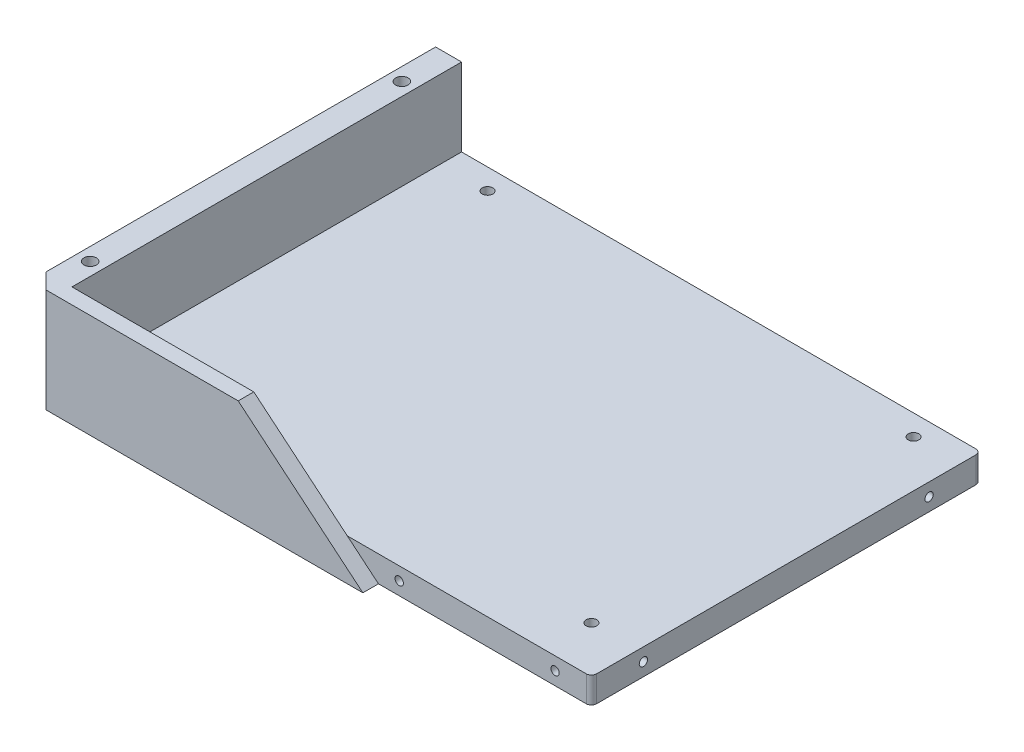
ISO-10303-21;
HEADER;
FILE_DESCRIPTION(('STEP AP214'),'2;1');
FILE_NAME('part.step','',(''),(''),'','','');
FILE_SCHEMA(('AUTOMOTIVE_DESIGN { 1 0 10303 214 1 1 1 1 }'));
ENDSEC;
DATA;
#1=APPLICATION_CONTEXT('core data for automotive mechanical design processes');
#2=APPLICATION_PROTOCOL_DEFINITION('international standard','automotive_design',2000,#1);
#3=PRODUCT_CONTEXT('',#1,'mechanical');
#4=PRODUCT('Part','Part','',(#3));
#5=PRODUCT_RELATED_PRODUCT_CATEGORY('part','',(#4));
#6=PRODUCT_DEFINITION_FORMATION('','',#4);
#7=PRODUCT_DEFINITION_CONTEXT('part definition',#1,'design');
#8=PRODUCT_DEFINITION('design','',#6,#7);
#9=PRODUCT_DEFINITION_SHAPE('','',#8);
#10=(LENGTH_UNIT() NAMED_UNIT(*) SI_UNIT(.MILLI.,.METRE.));
#11=(NAMED_UNIT(*) PLANE_ANGLE_UNIT() SI_UNIT($,.RADIAN.));
#12=(NAMED_UNIT(*) SI_UNIT($,.STERADIAN.) SOLID_ANGLE_UNIT());
#13=UNCERTAINTY_MEASURE_WITH_UNIT(LENGTH_MEASURE(1.E-05),#10,'distance_accuracy_value','');
#14=(GEOMETRIC_REPRESENTATION_CONTEXT(3) GLOBAL_UNCERTAINTY_ASSIGNED_CONTEXT((#13)) GLOBAL_UNIT_ASSIGNED_CONTEXT((#10,
#11,#12)) REPRESENTATION_CONTEXT('',''));
#15=CARTESIAN_POINT('',(0.,0.,0.));
#16=DIRECTION('',(0.,0.,1.));
#17=DIRECTION('',(1.,0.,0.));
#18=AXIS2_PLACEMENT_3D('',#15,#16,#17);
#19=CARTESIAN_POINT('',(0.,20.,48.));
#20=DIRECTION('',(1.,0.,0.));
#21=DIRECTION('',(0.,1.,0.));
#22=AXIS2_PLACEMENT_3D('',#19,#20,#21);
#23=PLANE('',#22);
#24=DIRECTION('',(0.,0.,1.));
#25=VECTOR('',#24,1.);
#26=CARTESIAN_POINT('',(0.,4.84142135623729,43.));
#27=LINE('',#26,#25);
#28=CARTESIAN_POINT('',(0.,4.84142135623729,-28.));
#29=VERTEX_POINT('',#28);
#30=CARTESIAN_POINT('',(0.,4.84142135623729,43.));
#31=VERTEX_POINT('',#30);
#32=EDGE_CURVE('E387',#29,#31,#27,.T.);
#33=ORIENTED_EDGE('',*,*,#32,.T.);
#34=DIRECTION('',(0.,1.,0.));
#35=VECTOR('',#34,1.);
#36=CARTESIAN_POINT('',(0.,0.,43.));
#37=LINE('',#36,#35);
#38=CARTESIAN_POINT('',(0.,0.,43.));
#39=VERTEX_POINT('',#38);
#40=EDGE_CURVE('E439',#39,#31,#37,.T.);
#41=ORIENTED_EDGE('',*,*,#40,.F.);
#42=DIRECTION('',(0.,0.,-1.));
#43=VECTOR('',#42,1.);
#44=CARTESIAN_POINT('',(0.,0.,48.));
#45=LINE('',#44,#43);
#46=CARTESIAN_POINT('',(0.,0.,45.));
#47=VERTEX_POINT('',#46);
#48=EDGE_CURVE('E354',#47,#39,#45,.T.);
#49=ORIENTED_EDGE('',*,*,#48,.F.);
#50=DIRECTION('',(0.,1.,0.));
#51=VECTOR('',#50,1.);
#52=CARTESIAN_POINT('',(0.,20.,45.));
#53=LINE('',#52,#51);
#54=CARTESIAN_POINT('',(0.,20.,45.));
#55=VERTEX_POINT('',#54);
#56=EDGE_CURVE('E365',#47,#55,#53,.T.);
#57=ORIENTED_EDGE('',*,*,#56,.T.);
#58=DIRECTION('',(0.,0.,-1.));
#59=VECTOR('',#58,1.);
#60=CARTESIAN_POINT('',(0.,20.,48.));
#61=LINE('',#60,#59);
#62=CARTESIAN_POINT('',(0.,20.,-30.));
#63=VERTEX_POINT('',#62);
#64=EDGE_CURVE('E357',#55,#63,#61,.T.);
#65=ORIENTED_EDGE('',*,*,#64,.T.);
#66=DIRECTION('',(0.,1.,0.));
#67=VECTOR('',#66,1.);
#68=CARTESIAN_POINT('',(0.,0.,-30.));
#69=LINE('',#68,#67);
#70=CARTESIAN_POINT('',(0.,0.,-30.));
#71=VERTEX_POINT('',#70);
#72=EDGE_CURVE('E298',#71,#63,#69,.T.);
#73=ORIENTED_EDGE('',*,*,#72,.F.);
#74=CARTESIAN_POINT('',(0.,0.,-28.));
#75=VERTEX_POINT('',#74);
#76=EDGE_CURVE('E353',#75,#71,#45,.T.);
#77=ORIENTED_EDGE('',*,*,#76,.F.);
#78=DIRECTION('',(0.,-1.,0.));
#79=VECTOR('',#78,1.);
#80=CARTESIAN_POINT('',(0.,0.,-28.));
#81=LINE('',#80,#79);
#82=EDGE_CURVE('E434',#29,#75,#81,.T.);
#83=ORIENTED_EDGE('',*,*,#82,.F.);
#84=EDGE_LOOP('',(#33,#41,#49,#57,#65,#73,#77,#83));
#85=FACE_BOUND('',#84,.T.);
#86=ADVANCED_FACE('F45',(#85),#23,.F.);
#87=CARTESIAN_POINT('',(110.,0.,45.));
#88=DIRECTION('',(0.,0.,-1.));
#89=DIRECTION('',(-1.,0.,0.));
#90=AXIS2_PLACEMENT_3D('',#87,#88,#89);
#91=PLANE('',#90);
#92=CARTESIAN_POINT('',(98.,2.5,45.));
#93=DIRECTION('',(0.,0.,1.));
#94=DIRECTION('',(1.,0.,0.));
#95=AXIS2_PLACEMENT_3D('',#92,#93,#94);
#96=CIRCLE('',#95,0.799999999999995);
#97=CARTESIAN_POINT('',(98.8,2.5,45.));
#98=VERTEX_POINT('',#97);
#99=EDGE_CURVE('E264',#98,#98,#96,.T.);
#100=ORIENTED_EDGE('',*,*,#99,.F.);
#101=EDGE_LOOP('',(#100));
#102=FACE_BOUND('',#101,.T.);
#103=CARTESIAN_POINT('',(68.,2.5,45.));
#104=DIRECTION('',(0.,0.,1.));
#105=DIRECTION('',(1.,0.,0.));
#106=AXIS2_PLACEMENT_3D('',#103,#104,#105);
#107=CIRCLE('',#106,0.799999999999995);
#108=CARTESIAN_POINT('',(68.8,2.5,45.));
#109=VERTEX_POINT('',#108);
#110=EDGE_CURVE('E258',#109,#109,#107,.T.);
#111=ORIENTED_EDGE('',*,*,#110,.F.);
#112=EDGE_LOOP('',(#111));
#113=FACE_BOUND('',#112,.T.);
#114=DIRECTION('',(-0.768221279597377,0.640184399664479,0.));
#115=VECTOR('',#114,1.);
#116=CARTESIAN_POINT('',(58.,4.99999999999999,45.));
#117=LINE('',#116,#115);
#118=CARTESIAN_POINT('',(64.,0.,45.));
#119=VERTEX_POINT('',#118);
#120=CARTESIAN_POINT('',(58.,4.99999999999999,45.));
#121=VERTEX_POINT('',#120);
#122=EDGE_CURVE('E225',#119,#121,#117,.T.);
#123=ORIENTED_EDGE('',*,*,#122,.F.);
#124=DIRECTION('',(-1.,0.,0.));
#125=VECTOR('',#124,1.);
#126=CARTESIAN_POINT('',(110.,0.,45.));
#127=LINE('',#126,#125);
#128=CARTESIAN_POINT('',(104.,0.,45.));
#129=VERTEX_POINT('',#128);
#130=EDGE_CURVE('E224',#129,#119,#127,.T.);
#131=ORIENTED_EDGE('',*,*,#130,.F.);
#132=DIRECTION('',(0.,1.,0.));
#133=VECTOR('',#132,1.);
#134=CARTESIAN_POINT('',(104.,0.,45.));
#135=LINE('',#134,#133);
#136=CARTESIAN_POINT('',(104.,5.,45.));
#137=VERTEX_POINT('',#136);
#138=EDGE_CURVE('E384',#129,#137,#135,.T.);
#139=ORIENTED_EDGE('',*,*,#138,.T.);
#140=DIRECTION('',(-1.,0.,0.));
#141=VECTOR('',#140,1.);
#142=CARTESIAN_POINT('',(110.,5.,45.));
#143=LINE('',#142,#141);
#144=EDGE_CURVE('E336',#137,#121,#143,.T.);
#145=ORIENTED_EDGE('',*,*,#144,.T.);
#146=EDGE_LOOP('',(#123,#131,#139,#145));
#147=FACE_BOUND('',#146,.T.);
#148=ADVANCED_FACE('F484',(#102,#113,#147),#91,.F.);
#149=CARTESIAN_POINT('',(40.,20.,48.));
#150=DIRECTION('',(-0.64018439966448,-0.768221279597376,0.));
#151=DIRECTION('',(0.768221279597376,-0.64018439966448,0.));
#152=AXIS2_PLACEMENT_3D('',#149,#150,#151);
#153=PLANE('',#152);
#154=DIRECTION('',(-0.768221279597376,0.64018439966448,0.));
#155=VECTOR('',#154,1.);
#156=CARTESIAN_POINT('',(40.,20.,48.));
#157=LINE('',#156,#155);
#158=CARTESIAN_POINT('',(64.,0.,48.));
#159=VERTEX_POINT('',#158);
#160=CARTESIAN_POINT('',(40.,20.,48.));
#161=VERTEX_POINT('',#160);
#162=EDGE_CURVE('E203',#159,#161,#157,.T.);
#163=ORIENTED_EDGE('',*,*,#162,.F.);
#164=DIRECTION('',(0.,0.,-1.));
#165=VECTOR('',#164,1.);
#166=CARTESIAN_POINT('',(64.,0.,55.8102496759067));
#167=LINE('',#166,#165);
#168=EDGE_CURVE('E214',#159,#119,#167,.T.);
#169=ORIENTED_EDGE('',*,*,#168,.T.);
#170=ORIENTED_EDGE('',*,*,#122,.T.);
#171=DIRECTION('',(-0.768221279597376,0.64018439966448,0.));
#172=VECTOR('',#171,1.);
#173=CARTESIAN_POINT('',(40.,20.,45.));
#174=LINE('',#173,#172);
#175=CARTESIAN_POINT('',(40.0000000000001,20.,45.));
#176=VERTEX_POINT('',#175);
#177=EDGE_CURVE('E360',#121,#176,#174,.T.);
#178=ORIENTED_EDGE('',*,*,#177,.T.);
#179=DIRECTION('',(0.,0.,-1.));
#180=VECTOR('',#179,1.);
#181=CARTESIAN_POINT('',(40.,20.,48.));
#182=LINE('',#181,#180);
#183=EDGE_CURVE('E217',#161,#176,#182,.T.);
#184=ORIENTED_EDGE('',*,*,#183,.F.);
#185=EDGE_LOOP('',(#163,#169,#170,#178,#184));
#186=FACE_BOUND('',#185,.T.);
#187=ADVANCED_FACE('F212',(#186),#153,.F.);
#188=CARTESIAN_POINT('',(40.,20.,48.));
#189=DIRECTION('',(0.,-1.,0.));
#190=DIRECTION('',(1.,0.,0.));
#191=AXIS2_PLACEMENT_3D('',#188,#189,#190);
#192=PLANE('',#191);
#193=CARTESIAN_POINT('',(2.5,20.,-21.));
#194=DIRECTION('',(0.,-1.,0.));
#195=DIRECTION('',(0.,0.,-1.));
#196=AXIS2_PLACEMENT_3D('',#193,#194,#195);
#197=CIRCLE('',#196,1.19999999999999);
#198=CARTESIAN_POINT('',(2.5,20.,-22.2));
#199=VERTEX_POINT('',#198);
#200=EDGE_CURVE('E243',#199,#199,#197,.T.);
#201=ORIENTED_EDGE('',*,*,#200,.T.);
#202=EDGE_LOOP('',(#201));
#203=FACE_BOUND('',#202,.T.);
#204=CARTESIAN_POINT('',(2.5,20.,39.));
#205=DIRECTION('',(0.,-1.,0.));
#206=DIRECTION('',(0.,0.,-1.));
#207=AXIS2_PLACEMENT_3D('',#204,#205,#206);
#208=CIRCLE('',#207,1.19999999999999);
#209=CARTESIAN_POINT('',(2.5,20.,37.8));
#210=VERTEX_POINT('',#209);
#211=EDGE_CURVE('E255',#210,#210,#208,.T.);
#212=ORIENTED_EDGE('',*,*,#211,.T.);
#213=EDGE_LOOP('',(#212));
#214=FACE_BOUND('',#213,.T.);
#215=DIRECTION('',(0.,0.,1.));
#216=VECTOR('',#215,1.);
#217=CARTESIAN_POINT('',(5.,20.,45.));
#218=LINE('',#217,#216);
#219=CARTESIAN_POINT('',(5.,20.,-30.));
#220=VERTEX_POINT('',#219);
#221=CARTESIAN_POINT('',(5.,20.,45.));
#222=VERTEX_POINT('',#221);
#223=EDGE_CURVE('E339',#220,#222,#218,.T.);
#224=ORIENTED_EDGE('',*,*,#223,.F.);
#225=DIRECTION('',(1.,0.,0.));
#226=VECTOR('',#225,1.);
#227=CARTESIAN_POINT('',(0.,20.,-30.));
#228=LINE('',#227,#226);
#229=EDGE_CURVE('E294',#63,#220,#228,.T.);
#230=ORIENTED_EDGE('',*,*,#229,.F.);
#231=ORIENTED_EDGE('',*,*,#64,.F.);
#232=DIRECTION('',(0.707106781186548,0.,0.707106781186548));
#233=VECTOR('',#232,1.);
#234=CARTESIAN_POINT('',(3.,20.,48.));
#235=LINE('',#234,#233);
#236=CARTESIAN_POINT('',(3.,20.,48.));
#237=VERTEX_POINT('',#236);
#238=EDGE_CURVE('E367',#55,#237,#235,.T.);
#239=ORIENTED_EDGE('',*,*,#238,.T.);
#240=DIRECTION('',(-1.,0.,0.));
#241=VECTOR('',#240,1.);
#242=CARTESIAN_POINT('',(40.,20.,48.));
#243=LINE('',#242,#241);
#244=EDGE_CURVE('E208',#161,#237,#243,.T.);
#245=ORIENTED_EDGE('',*,*,#244,.F.);
#246=ORIENTED_EDGE('',*,*,#183,.T.);
#247=DIRECTION('',(1.,0.,0.));
#248=VECTOR('',#247,1.);
#249=CARTESIAN_POINT('',(111.,20.,45.));
#250=LINE('',#249,#248);
#251=EDGE_CURVE('E341',#222,#176,#250,.T.);
#252=ORIENTED_EDGE('',*,*,#251,.F.);
#253=EDGE_LOOP('',(#224,#230,#231,#239,#245,#246,#252));
#254=FACE_BOUND('',#253,.T.);
#255=ADVANCED_FACE('F469',(#203,#214,#254),#192,.F.);
#256=CARTESIAN_POINT('',(0.,0.,48.));
#257=DIRECTION('',(0.,1.,0.));
#258=DIRECTION('',(0.,0.,1.));
#259=AXIS2_PLACEMENT_3D('',#256,#257,#258);
#260=PLANE('',#259);
#261=CARTESIAN_POINT('',(20.,0.,-18.));
#262=DIRECTION('',(0.,-1.,0.));
#263=DIRECTION('',(0.,0.,-1.));
#264=AXIS2_PLACEMENT_3D('',#261,#262,#263);
#265=CIRCLE('',#264,4.05);
#266=CARTESIAN_POINT('',(20.,0.,-22.05));
#267=VERTEX_POINT('',#266);
#268=EDGE_CURVE('E458',#267,#267,#265,.T.);
#269=ORIENTED_EDGE('',*,*,#268,.F.);
#270=EDGE_LOOP('',(#269));
#271=FACE_BOUND('',#270,.T.);
#272=CARTESIAN_POINT('',(88.,0.,-18.));
#273=DIRECTION('',(0.,-1.,0.));
#274=DIRECTION('',(0.,0.,-1.));
#275=AXIS2_PLACEMENT_3D('',#272,#273,#274);
#276=CIRCLE('',#275,4.05);
#277=CARTESIAN_POINT('',(88.,0.,-22.05));
#278=VERTEX_POINT('',#277);
#279=EDGE_CURVE('E452',#278,#278,#276,.T.);
#280=ORIENTED_EDGE('',*,*,#279,.F.);
#281=EDGE_LOOP('',(#280));
#282=FACE_BOUND('',#281,.T.);
#283=CARTESIAN_POINT('',(88.,0.,33.));
#284=DIRECTION('',(0.,-1.,0.));
#285=DIRECTION('',(0.,0.,-1.));
#286=AXIS2_PLACEMENT_3D('',#283,#284,#285);
#287=CIRCLE('',#286,4.05);
#288=CARTESIAN_POINT('',(88.,0.,28.95));
#289=VERTEX_POINT('',#288);
#290=EDGE_CURVE('E446',#289,#289,#287,.T.);
#291=ORIENTED_EDGE('',*,*,#290,.F.);
#292=EDGE_LOOP('',(#291));
#293=FACE_BOUND('',#292,.T.);
#294=CARTESIAN_POINT('',(20.,0.,33.));
#295=DIRECTION('',(0.,-1.,0.));
#296=DIRECTION('',(0.,0.,-1.));
#297=AXIS2_PLACEMENT_3D('',#294,#295,#296);
#298=CIRCLE('',#297,4.05);
#299=CARTESIAN_POINT('',(20.,0.,28.95));
#300=VERTEX_POINT('',#299);
#301=EDGE_CURVE('E231',#300,#300,#298,.T.);
#302=ORIENTED_EDGE('',*,*,#301,.F.);
#303=EDGE_LOOP('',(#302));
#304=FACE_BOUND('',#303,.T.);
#305=DIRECTION('',(1.,0.,0.));
#306=VECTOR('',#305,1.);
#307=CARTESIAN_POINT('',(-2.,0.,43.));
#308=LINE('',#307,#306);
#309=CARTESIAN_POINT('',(-1.69999999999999,0.,43.));
#310=VERTEX_POINT('',#309);
#311=EDGE_CURVE('E441',#310,#39,#308,.T.);
#312=ORIENTED_EDGE('',*,*,#311,.F.);
#313=DIRECTION('',(0.,0.,-1.));
#314=VECTOR('',#313,1.);
#315=CARTESIAN_POINT('',(-1.69999999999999,0.,48.));
#316=LINE('',#315,#314);
#317=CARTESIAN_POINT('',(-1.69999999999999,0.,-28.));
#318=VERTEX_POINT('',#317);
#319=EDGE_CURVE('E55',#310,#318,#316,.T.);
#320=ORIENTED_EDGE('',*,*,#319,.T.);
#321=DIRECTION('',(1.,0.,0.));
#322=VECTOR('',#321,1.);
#323=CARTESIAN_POINT('',(-2.,0.,-28.));
#324=LINE('',#323,#322);
#325=EDGE_CURVE('E443',#318,#75,#324,.T.);
#326=ORIENTED_EDGE('',*,*,#325,.T.);
#327=ORIENTED_EDGE('',*,*,#76,.T.);
#328=DIRECTION('',(1.,0.,0.));
#329=VECTOR('',#328,1.);
#330=CARTESIAN_POINT('',(0.,0.,-30.));
#331=LINE('',#330,#329);
#332=CARTESIAN_POINT('',(104.,0.,-30.));
#333=VERTEX_POINT('',#332);
#334=EDGE_CURVE('E295',#71,#333,#331,.T.);
#335=ORIENTED_EDGE('',*,*,#334,.T.);
#336=CARTESIAN_POINT('',(104.,0.,-29.));
#337=DIRECTION('',(0.,1.,0.));
#338=DIRECTION('',(0.,0.,1.));
#339=AXIS2_PLACEMENT_3D('',#336,#337,#338);
#340=CIRCLE('',#339,1.);
#341=CARTESIAN_POINT('',(105.,0.,-29.));
#342=VERTEX_POINT('',#341);
#343=EDGE_CURVE('E382',#333,#342,#340,.F.);
#344=ORIENTED_EDGE('',*,*,#343,.T.);
#345=DIRECTION('',(0.,0.,1.));
#346=VECTOR('',#345,1.);
#347=CARTESIAN_POINT('',(105.,0.,-45.));
#348=LINE('',#347,#346);
#349=CARTESIAN_POINT('',(105.,0.,44.));
#350=VERTEX_POINT('',#349);
#351=EDGE_CURVE('E331',#342,#350,#348,.T.);
#352=ORIENTED_EDGE('',*,*,#351,.T.);
#353=CARTESIAN_POINT('',(104.,0.,44.));
#354=DIRECTION('',(0.,1.,0.));
#355=DIRECTION('',(0.,0.,1.));
#356=AXIS2_PLACEMENT_3D('',#353,#354,#355);
#357=CIRCLE('',#356,1.);
#358=EDGE_CURVE('E380',#350,#129,#357,.F.);
#359=ORIENTED_EDGE('',*,*,#358,.T.);
#360=ORIENTED_EDGE('',*,*,#130,.T.);
#361=ORIENTED_EDGE('',*,*,#168,.F.);
#362=DIRECTION('',(1.,0.,0.));
#363=VECTOR('',#362,1.);
#364=CARTESIAN_POINT('',(0.,0.,48.));
#365=LINE('',#364,#363);
#366=CARTESIAN_POINT('',(3.,0.,48.));
#367=VERTEX_POINT('',#366);
#368=EDGE_CURVE('E199',#367,#159,#365,.T.);
#369=ORIENTED_EDGE('',*,*,#368,.F.);
#370=DIRECTION('',(-0.707106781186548,0.,-0.707106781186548));
#371=VECTOR('',#370,1.);
#372=CARTESIAN_POINT('',(3.,0.,48.));
#373=LINE('',#372,#371);
#374=EDGE_CURVE('E363',#367,#47,#373,.T.);
#375=ORIENTED_EDGE('',*,*,#374,.T.);
#376=ORIENTED_EDGE('',*,*,#48,.T.);
#377=EDGE_LOOP('',(#312,#320,#326,#327,#335,#344,#352,#359,#360,#361,#369,#375,#376));
#378=FACE_BOUND('',#377,.T.);
#379=CARTESIAN_POINT('',(2.5,0.,-21.));
#380=DIRECTION('',(0.,-1.,0.));
#381=DIRECTION('',(0.,0.,-1.));
#382=AXIS2_PLACEMENT_3D('',#379,#380,#381);
#383=CIRCLE('',#382,2.15);
#384=CARTESIAN_POINT('',(2.5,0.,-23.15));
#385=VERTEX_POINT('',#384);
#386=EDGE_CURVE('E228',#385,#385,#383,.T.);
#387=ORIENTED_EDGE('',*,*,#386,.F.);
#388=EDGE_LOOP('',(#387));
#389=FACE_BOUND('',#388,.T.);
#390=CARTESIAN_POINT('',(2.5,0.,39.));
#391=DIRECTION('',(0.,-1.,0.));
#392=DIRECTION('',(0.,0.,-1.));
#393=AXIS2_PLACEMENT_3D('',#390,#391,#392);
#394=CIRCLE('',#393,2.15);
#395=CARTESIAN_POINT('',(2.5,0.,36.85));
#396=VERTEX_POINT('',#395);
#397=EDGE_CURVE('E246',#396,#396,#394,.T.);
#398=ORIENTED_EDGE('',*,*,#397,.F.);
#399=EDGE_LOOP('',(#398));
#400=FACE_BOUND('',#399,.T.);
#401=CARTESIAN_POINT('',(14.,0.,-26.));
#402=DIRECTION('',(0.,1.,0.));
#403=DIRECTION('',(0.,0.,1.));
#404=AXIS2_PLACEMENT_3D('',#401,#402,#403);
#405=CIRCLE('',#404,1.02499999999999);
#406=CARTESIAN_POINT('',(14.,0.,-24.975));
#407=VERTEX_POINT('',#406);
#408=EDGE_CURVE('E309',#407,#407,#405,.T.);
#409=ORIENTED_EDGE('',*,*,#408,.T.);
#410=EDGE_LOOP('',(#409));
#411=FACE_BOUND('',#410,.T.);
#412=CARTESIAN_POINT('',(96.,0.,36.));
#413=DIRECTION('',(0.,1.,0.));
#414=DIRECTION('',(0.,0.,1.));
#415=AXIS2_PLACEMENT_3D('',#412,#413,#414);
#416=CIRCLE('',#415,1.02499999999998);
#417=CARTESIAN_POINT('',(96.,0.,37.0249999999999));
#418=VERTEX_POINT('',#417);
#419=EDGE_CURVE('E315',#418,#418,#416,.T.);
#420=ORIENTED_EDGE('',*,*,#419,.T.);
#421=EDGE_LOOP('',(#420));
#422=FACE_BOUND('',#421,.T.);
#423=CARTESIAN_POINT('',(14.,0.,36.));
#424=DIRECTION('',(0.,1.,0.));
#425=DIRECTION('',(0.,0.,1.));
#426=AXIS2_PLACEMENT_3D('',#423,#424,#425);
#427=CIRCLE('',#426,1.02499999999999);
#428=CARTESIAN_POINT('',(14.,0.,37.025));
#429=VERTEX_POINT('',#428);
#430=EDGE_CURVE('E321',#429,#429,#427,.T.);
#431=ORIENTED_EDGE('',*,*,#430,.T.);
#432=EDGE_LOOP('',(#431));
#433=FACE_BOUND('',#432,.T.);
#434=CARTESIAN_POINT('',(96.,0.,-26.));
#435=DIRECTION('',(0.,1.,0.));
#436=DIRECTION('',(0.,0.,1.));
#437=AXIS2_PLACEMENT_3D('',#434,#435,#436);
#438=CIRCLE('',#437,1.02499999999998);
#439=CARTESIAN_POINT('',(96.,0.,-24.975));
#440=VERTEX_POINT('',#439);
#441=EDGE_CURVE('E327',#440,#440,#438,.T.);
#442=ORIENTED_EDGE('',*,*,#441,.T.);
#443=EDGE_LOOP('',(#442));
#444=FACE_BOUND('',#443,.T.);
#445=ADVANCED_FACE('F221',(#271,#282,#293,#304,#378,#389,#400,#411,#422,#433,#444),#260,.F.);
#446=CARTESIAN_POINT('',(110.,5.,48.));
#447=DIRECTION('',(0.,-1.,0.));
#448=DIRECTION('',(1.,0.,0.));
#449=AXIS2_PLACEMENT_3D('',#446,#447,#448);
#450=PLANE('',#449);
#451=CARTESIAN_POINT('',(14.,4.99999999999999,-26.));
#452=DIRECTION('',(0.,1.,0.));
#453=DIRECTION('',(0.,0.,1.));
#454=AXIS2_PLACEMENT_3D('',#451,#452,#453);
#455=CIRCLE('',#454,1.02499999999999);
#456=CARTESIAN_POINT('',(14.,4.99999999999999,-24.975));
#457=VERTEX_POINT('',#456);
#458=EDGE_CURVE('E306',#457,#457,#455,.T.);
#459=ORIENTED_EDGE('',*,*,#458,.F.);
#460=EDGE_LOOP('',(#459));
#461=FACE_BOUND('',#460,.T.);
#462=CARTESIAN_POINT('',(96.,5.,36.));
#463=DIRECTION('',(0.,1.,0.));
#464=DIRECTION('',(0.,0.,1.));
#465=AXIS2_PLACEMENT_3D('',#462,#463,#464);
#466=CIRCLE('',#465,1.02499999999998);
#467=CARTESIAN_POINT('',(96.,5.,37.0249999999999));
#468=VERTEX_POINT('',#467);
#469=EDGE_CURVE('E312',#468,#468,#466,.T.);
#470=ORIENTED_EDGE('',*,*,#469,.F.);
#471=EDGE_LOOP('',(#470));
#472=FACE_BOUND('',#471,.T.);
#473=CARTESIAN_POINT('',(14.,4.99999999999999,36.));
#474=DIRECTION('',(0.,1.,0.));
#475=DIRECTION('',(0.,0.,1.));
#476=AXIS2_PLACEMENT_3D('',#473,#474,#475);
#477=CIRCLE('',#476,1.02499999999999);
#478=CARTESIAN_POINT('',(14.,4.99999999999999,37.025));
#479=VERTEX_POINT('',#478);
#480=EDGE_CURVE('E318',#479,#479,#477,.T.);
#481=ORIENTED_EDGE('',*,*,#480,.F.);
#482=EDGE_LOOP('',(#481));
#483=FACE_BOUND('',#482,.T.);
#484=CARTESIAN_POINT('',(96.,5.,-26.));
#485=DIRECTION('',(0.,1.,0.));
#486=DIRECTION('',(0.,0.,1.));
#487=AXIS2_PLACEMENT_3D('',#484,#485,#486);
#488=CIRCLE('',#487,1.02499999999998);
#489=CARTESIAN_POINT('',(96.,5.,-24.975));
#490=VERTEX_POINT('',#489);
#491=EDGE_CURVE('E324',#490,#490,#488,.T.);
#492=ORIENTED_EDGE('',*,*,#491,.F.);
#493=EDGE_LOOP('',(#492));
#494=FACE_BOUND('',#493,.T.);
#495=DIRECTION('',(0.,0.,1.));
#496=VECTOR('',#495,1.);
#497=CARTESIAN_POINT('',(105.,5.,-45.));
#498=LINE('',#497,#496);
#499=CARTESIAN_POINT('',(105.,5.,-29.));
#500=VERTEX_POINT('',#499);
#501=CARTESIAN_POINT('',(105.,5.,44.));
#502=VERTEX_POINT('',#501);
#503=EDGE_CURVE('E330',#500,#502,#498,.T.);
#504=ORIENTED_EDGE('',*,*,#503,.F.);
#505=CARTESIAN_POINT('',(104.,5.,-29.));
#506=DIRECTION('',(0.,-1.,0.));
#507=DIRECTION('',(1.,0.,0.));
#508=AXIS2_PLACEMENT_3D('',#505,#506,#507);
#509=CIRCLE('',#508,1.);
#510=CARTESIAN_POINT('',(104.,5.,-30.));
#511=VERTEX_POINT('',#510);
#512=EDGE_CURVE('E376',#500,#511,#509,.F.);
#513=ORIENTED_EDGE('',*,*,#512,.T.);
#514=DIRECTION('',(-1.,0.,0.));
#515=VECTOR('',#514,1.);
#516=CARTESIAN_POINT('',(110.,5.,-30.));
#517=LINE('',#516,#515);
#518=CARTESIAN_POINT('',(5.00000000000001,5.,-30.));
#519=VERTEX_POINT('',#518);
#520=EDGE_CURVE('E304',#511,#519,#517,.T.);
#521=ORIENTED_EDGE('',*,*,#520,.T.);
#522=DIRECTION('',(0.,0.,1.));
#523=VECTOR('',#522,1.);
#524=CARTESIAN_POINT('',(5.00000000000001,5.,45.));
#525=LINE('',#524,#523);
#526=CARTESIAN_POINT('',(5.,4.99999999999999,45.));
#527=VERTEX_POINT('',#526);
#528=EDGE_CURVE('E346',#519,#527,#525,.T.);
#529=ORIENTED_EDGE('',*,*,#528,.T.);
#530=DIRECTION('',(1.,0.,0.));
#531=VECTOR('',#530,1.);
#532=CARTESIAN_POINT('',(111.,5.,45.));
#533=LINE('',#532,#531);
#534=EDGE_CURVE('E343',#527,#121,#533,.T.);
#535=ORIENTED_EDGE('',*,*,#534,.T.);
#536=ORIENTED_EDGE('',*,*,#144,.F.);
#537=CARTESIAN_POINT('',(104.,5.,44.));
#538=DIRECTION('',(0.,-1.,0.));
#539=DIRECTION('',(1.,0.,0.));
#540=AXIS2_PLACEMENT_3D('',#537,#538,#539);
#541=CIRCLE('',#540,1.);
#542=EDGE_CURVE('E374',#137,#502,#541,.F.);
#543=ORIENTED_EDGE('',*,*,#542,.T.);
#544=EDGE_LOOP('',(#504,#513,#521,#529,#535,#536,#543));
#545=FACE_BOUND('',#544,.T.);
#546=ADVANCED_FACE('F468',(#461,#472,#483,#494,#545),#450,.F.);
#547=CARTESIAN_POINT('',(0.,0.,48.));
#548=DIRECTION('',(0.,0.,1.));
#549=DIRECTION('',(1.,0.,0.));
#550=AXIS2_PLACEMENT_3D('',#547,#548,#549);
#551=PLANE('',#550);
#552=ORIENTED_EDGE('',*,*,#244,.T.);
#553=DIRECTION('',(0.,-1.,0.));
#554=VECTOR('',#553,1.);
#555=CARTESIAN_POINT('',(3.,0.,48.));
#556=LINE('',#555,#554);
#557=EDGE_CURVE('E206',#237,#367,#556,.T.);
#558=ORIENTED_EDGE('',*,*,#557,.T.);
#559=ORIENTED_EDGE('',*,*,#368,.T.);
#560=ORIENTED_EDGE('',*,*,#162,.T.);
#561=EDGE_LOOP('',(#552,#558,#559,#560));
#562=FACE_BOUND('',#561,.T.);
#563=ADVANCED_FACE('F202',(#562),#551,.T.);
#564=CARTESIAN_POINT('',(111.,-134.05394636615,45.));
#565=DIRECTION('',(0.,0.,1.));
#566=DIRECTION('',(1.,0.,0.));
#567=AXIS2_PLACEMENT_3D('',#564,#565,#566);
#568=PLANE('',#567);
#569=ORIENTED_EDGE('',*,*,#534,.F.);
#570=DIRECTION('',(0.,1.,0.));
#571=VECTOR('',#570,1.);
#572=CARTESIAN_POINT('',(5.00000000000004,-134.05394636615,45.));
#573=LINE('',#572,#571);
#574=EDGE_CURVE('E348',#527,#222,#573,.T.);
#575=ORIENTED_EDGE('',*,*,#574,.T.);
#576=ORIENTED_EDGE('',*,*,#251,.T.);
#577=ORIENTED_EDGE('',*,*,#177,.F.);
#578=EDGE_LOOP('',(#569,#575,#576,#577));
#579=FACE_BOUND('',#578,.T.);
#580=ADVANCED_FACE('F719',(#579),#568,.F.);
#581=CARTESIAN_POINT('',(5.00000000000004,-134.05394636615,45.));
#582=DIRECTION('',(-1.,0.,0.));
#583=DIRECTION('',(0.,-1.,0.));
#584=AXIS2_PLACEMENT_3D('',#581,#582,#583);
#585=PLANE('',#584);
#586=ORIENTED_EDGE('',*,*,#528,.F.);
#587=DIRECTION('',(0.,1.,0.));
#588=VECTOR('',#587,1.);
#589=CARTESIAN_POINT('',(5.00000000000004,-134.05394636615,-30.));
#590=LINE('',#589,#588);
#591=EDGE_CURVE('E301',#519,#220,#590,.T.);
#592=ORIENTED_EDGE('',*,*,#591,.T.);
#593=ORIENTED_EDGE('',*,*,#223,.T.);
#594=ORIENTED_EDGE('',*,*,#574,.F.);
#595=EDGE_LOOP('',(#586,#592,#593,#594));
#596=FACE_BOUND('',#595,.T.);
#597=ADVANCED_FACE('F714',(#596),#585,.F.);
#598=CARTESIAN_POINT('',(105.,0.,-45.));
#599=DIRECTION('',(-1.,0.,0.));
#600=DIRECTION('',(0.,0.,1.));
#601=AXIS2_PLACEMENT_3D('',#598,#599,#600);
#602=PLANE('',#601);
#603=CARTESIAN_POINT('',(105.,2.5,35.));
#604=DIRECTION('',(1.,0.,0.));
#605=DIRECTION('',(0.,0.,-1.));
#606=AXIS2_PLACEMENT_3D('',#603,#604,#605);
#607=CIRCLE('',#606,0.79999999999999);
#608=CARTESIAN_POINT('',(105.,2.5,34.2));
#609=VERTEX_POINT('',#608);
#610=EDGE_CURVE('E270',#609,#609,#607,.T.);
#611=ORIENTED_EDGE('',*,*,#610,.F.);
#612=EDGE_LOOP('',(#611));
#613=FACE_BOUND('',#612,.T.);
#614=CARTESIAN_POINT('',(105.,2.5,-20.));
#615=DIRECTION('',(1.,0.,0.));
#616=DIRECTION('',(0.,0.,-1.));
#617=AXIS2_PLACEMENT_3D('',#614,#615,#616);
#618=CIRCLE('',#617,0.79999999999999);
#619=CARTESIAN_POINT('',(105.,2.5,-20.8));
#620=VERTEX_POINT('',#619);
#621=EDGE_CURVE('E276',#620,#620,#618,.T.);
#622=ORIENTED_EDGE('',*,*,#621,.F.);
#623=EDGE_LOOP('',(#622));
#624=FACE_BOUND('',#623,.T.);
#625=ORIENTED_EDGE('',*,*,#351,.F.);
#626=DIRECTION('',(0.,1.,0.));
#627=VECTOR('',#626,1.);
#628=CARTESIAN_POINT('',(105.,0.,-29.));
#629=LINE('',#628,#627);
#630=EDGE_CURVE('E371',#342,#500,#629,.T.);
#631=ORIENTED_EDGE('',*,*,#630,.T.);
#632=ORIENTED_EDGE('',*,*,#503,.T.);
#633=DIRECTION('',(0.,1.,0.));
#634=VECTOR('',#633,1.);
#635=CARTESIAN_POINT('',(105.,0.,44.));
#636=LINE('',#635,#634);
#637=EDGE_CURVE('E369',#502,#350,#636,.F.);
#638=ORIENTED_EDGE('',*,*,#637,.T.);
#639=EDGE_LOOP('',(#625,#631,#632,#638));
#640=FACE_BOUND('',#639,.T.);
#641=ADVANCED_FACE('F565',(#613,#624,#640),#602,.F.);
#642=CARTESIAN_POINT('',(96.,5.,-26.));
#643=DIRECTION('',(0.,1.,0.));
#644=DIRECTION('',(0.,0.,1.));
#645=AXIS2_PLACEMENT_3D('',#642,#643,#644);
#646=CYLINDRICAL_SURFACE('',#645,1.02499999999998);
#647=ORIENTED_EDGE('',*,*,#491,.T.);
#648=EDGE_LOOP('',(#647));
#649=FACE_BOUND('',#648,.T.);
#650=ORIENTED_EDGE('',*,*,#441,.F.);
#651=EDGE_LOOP('',(#650));
#652=FACE_BOUND('',#651,.T.);
#653=ADVANCED_FACE('F708',(#649,#652),#646,.F.);
#654=CARTESIAN_POINT('',(14.,4.99999999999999,36.));
#655=DIRECTION('',(0.,1.,0.));
#656=DIRECTION('',(0.,0.,1.));
#657=AXIS2_PLACEMENT_3D('',#654,#655,#656);
#658=CYLINDRICAL_SURFACE('',#657,1.02499999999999);
#659=ORIENTED_EDGE('',*,*,#480,.T.);
#660=EDGE_LOOP('',(#659));
#661=FACE_BOUND('',#660,.T.);
#662=ORIENTED_EDGE('',*,*,#430,.F.);
#663=EDGE_LOOP('',(#662));
#664=FACE_BOUND('',#663,.T.);
#665=ADVANCED_FACE('F704',(#661,#664),#658,.F.);
#666=CARTESIAN_POINT('',(96.,5.,36.));
#667=DIRECTION('',(0.,1.,0.));
#668=DIRECTION('',(0.,0.,1.));
#669=AXIS2_PLACEMENT_3D('',#666,#667,#668);
#670=CYLINDRICAL_SURFACE('',#669,1.02499999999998);
#671=ORIENTED_EDGE('',*,*,#469,.T.);
#672=EDGE_LOOP('',(#671));
#673=FACE_BOUND('',#672,.T.);
#674=ORIENTED_EDGE('',*,*,#419,.F.);
#675=EDGE_LOOP('',(#674));
#676=FACE_BOUND('',#675,.T.);
#677=ADVANCED_FACE('F700',(#673,#676),#670,.F.);
#678=CARTESIAN_POINT('',(14.,4.99999999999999,-26.));
#679=DIRECTION('',(0.,1.,0.));
#680=DIRECTION('',(0.,0.,1.));
#681=AXIS2_PLACEMENT_3D('',#678,#679,#680);
#682=CYLINDRICAL_SURFACE('',#681,1.02499999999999);
#683=ORIENTED_EDGE('',*,*,#458,.T.);
#684=EDGE_LOOP('',(#683));
#685=FACE_BOUND('',#684,.T.);
#686=ORIENTED_EDGE('',*,*,#408,.F.);
#687=EDGE_LOOP('',(#686));
#688=FACE_BOUND('',#687,.T.);
#689=ADVANCED_FACE('F499',(#685,#688),#682,.F.);
#690=CARTESIAN_POINT('',(3.,0.,48.));
#691=DIRECTION('',(-0.707106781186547,0.,0.707106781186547));
#692=DIRECTION('',(0.,1.,0.));
#693=AXIS2_PLACEMENT_3D('',#690,#691,#692);
#694=PLANE('',#693);
#695=ORIENTED_EDGE('',*,*,#238,.F.);
#696=ORIENTED_EDGE('',*,*,#56,.F.);
#697=ORIENTED_EDGE('',*,*,#374,.F.);
#698=ORIENTED_EDGE('',*,*,#557,.F.);
#699=EDGE_LOOP('',(#695,#696,#697,#698));
#700=FACE_BOUND('',#699,.T.);
#701=ADVANCED_FACE('F493',(#700),#694,.T.);
#702=CARTESIAN_POINT('',(0.,0.,-30.));
#703=DIRECTION('',(0.,0.,1.));
#704=DIRECTION('',(1.,0.,0.));
#705=AXIS2_PLACEMENT_3D('',#702,#703,#704);
#706=PLANE('',#705);
#707=CARTESIAN_POINT('',(89.,2.5,-30.));
#708=DIRECTION('',(0.,0.,-1.));
#709=DIRECTION('',(-1.,0.,0.));
#710=AXIS2_PLACEMENT_3D('',#707,#708,#709);
#711=CIRCLE('',#710,0.799999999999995);
#712=CARTESIAN_POINT('',(88.2,2.5,-30.));
#713=VERTEX_POINT('',#712);
#714=EDGE_CURVE('E282',#713,#713,#711,.T.);
#715=ORIENTED_EDGE('',*,*,#714,.F.);
#716=EDGE_LOOP('',(#715));
#717=FACE_BOUND('',#716,.T.);
#718=CARTESIAN_POINT('',(19.,2.5,-30.));
#719=DIRECTION('',(0.,0.,-1.));
#720=DIRECTION('',(-1.,0.,0.));
#721=AXIS2_PLACEMENT_3D('',#718,#719,#720);
#722=CIRCLE('',#721,0.799999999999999);
#723=CARTESIAN_POINT('',(18.2,2.5,-30.));
#724=VERTEX_POINT('',#723);
#725=EDGE_CURVE('E288',#724,#724,#722,.T.);
#726=ORIENTED_EDGE('',*,*,#725,.F.);
#727=EDGE_LOOP('',(#726));
#728=FACE_BOUND('',#727,.T.);
#729=ORIENTED_EDGE('',*,*,#520,.F.);
#730=DIRECTION('',(0.,1.,0.));
#731=VECTOR('',#730,1.);
#732=CARTESIAN_POINT('',(104.,0.,-30.));
#733=LINE('',#732,#731);
#734=EDGE_CURVE('E378',#511,#333,#733,.F.);
#735=ORIENTED_EDGE('',*,*,#734,.T.);
#736=ORIENTED_EDGE('',*,*,#334,.F.);
#737=ORIENTED_EDGE('',*,*,#72,.T.);
#738=ORIENTED_EDGE('',*,*,#229,.T.);
#739=ORIENTED_EDGE('',*,*,#591,.F.);
#740=EDGE_LOOP('',(#729,#735,#736,#737,#738,#739));
#741=FACE_BOUND('',#740,.T.);
#742=ADVANCED_FACE('F498',(#717,#728,#741),#706,.F.);
#743=CARTESIAN_POINT('',(104.,0.,-29.));
#744=DIRECTION('',(0.,1.,0.));
#745=DIRECTION('',(-1.,0.,0.));
#746=AXIS2_PLACEMENT_3D('',#743,#744,#745);
#747=CYLINDRICAL_SURFACE('',#746,1.);
#748=ORIENTED_EDGE('',*,*,#343,.F.);
#749=ORIENTED_EDGE('',*,*,#734,.F.);
#750=ORIENTED_EDGE('',*,*,#512,.F.);
#751=ORIENTED_EDGE('',*,*,#630,.F.);
#752=EDGE_LOOP('',(#748,#749,#750,#751));
#753=FACE_BOUND('',#752,.T.);
#754=ADVANCED_FACE('F501',(#753),#747,.T.);
#755=CARTESIAN_POINT('',(104.,0.,44.));
#756=DIRECTION('',(0.,1.,0.));
#757=DIRECTION('',(-1.,0.,0.));
#758=AXIS2_PLACEMENT_3D('',#755,#756,#757);
#759=CYLINDRICAL_SURFACE('',#758,1.);
#760=ORIENTED_EDGE('',*,*,#358,.F.);
#761=ORIENTED_EDGE('',*,*,#637,.F.);
#762=ORIENTED_EDGE('',*,*,#542,.F.);
#763=ORIENTED_EDGE('',*,*,#138,.F.);
#764=EDGE_LOOP('',(#760,#761,#762,#763));
#765=FACE_BOUND('',#764,.T.);
#766=ADVANCED_FACE('F504',(#765),#759,.T.);
#767=CARTESIAN_POINT('',(19.,2.5,-24.8));
#768=DIRECTION('',(0.,0.,-1.));
#769=DIRECTION('',(-1.,0.,0.));
#770=AXIS2_PLACEMENT_3D('',#767,#768,#769);
#771=CONICAL_SURFACE('',#770,0.799999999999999,1.02974425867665);
#772=CARTESIAN_POINT('',(19.,2.5,-24.3193115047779));
#773=VERTEX_POINT('',#772);
#774=VERTEX_LOOP('',#773);
#775=FACE_BOUND('',#774,.T.);
#776=CARTESIAN_POINT('',(19.,2.5,-24.8));
#777=DIRECTION('',(0.,0.,-1.));
#778=DIRECTION('',(-1.,0.,0.));
#779=AXIS2_PLACEMENT_3D('',#776,#777,#778);
#780=CIRCLE('',#779,0.799999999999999);
#781=CARTESIAN_POINT('',(18.2,2.5,-24.8));
#782=VERTEX_POINT('',#781);
#783=EDGE_CURVE('E291',#782,#782,#780,.T.);
#784=ORIENTED_EDGE('',*,*,#783,.T.);
#785=EDGE_LOOP('',(#784));
#786=FACE_BOUND('',#785,.T.);
#787=ADVANCED_FACE('F508',(#775,#786),#771,.F.);
#788=CARTESIAN_POINT('',(19.,2.5,-30.));
#789=DIRECTION('',(0.,0.,-1.));
#790=DIRECTION('',(-1.,0.,0.));
#791=AXIS2_PLACEMENT_3D('',#788,#789,#790);
#792=CYLINDRICAL_SURFACE('',#791,0.799999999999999);
#793=ORIENTED_EDGE('',*,*,#783,.F.);
#794=EDGE_LOOP('',(#793));
#795=FACE_BOUND('',#794,.T.);
#796=ORIENTED_EDGE('',*,*,#725,.T.);
#797=EDGE_LOOP('',(#796));
#798=FACE_BOUND('',#797,.T.);
#799=ADVANCED_FACE('F687',(#795,#798),#792,.F.);
#800=CARTESIAN_POINT('',(89.,2.5,-24.8));
#801=DIRECTION('',(0.,0.,-1.));
#802=DIRECTION('',(-1.,0.,0.));
#803=AXIS2_PLACEMENT_3D('',#800,#801,#802);
#804=CONICAL_SURFACE('',#803,0.799999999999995,1.02974425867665);
#805=CARTESIAN_POINT('',(89.,2.5,-24.3193115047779));
#806=VERTEX_POINT('',#805);
#807=VERTEX_LOOP('',#806);
#808=FACE_BOUND('',#807,.T.);
#809=CARTESIAN_POINT('',(89.,2.5,-24.8));
#810=DIRECTION('',(0.,0.,-1.));
#811=DIRECTION('',(-1.,0.,0.));
#812=AXIS2_PLACEMENT_3D('',#809,#810,#811);
#813=CIRCLE('',#812,0.799999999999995);
#814=CARTESIAN_POINT('',(88.2,2.5,-24.8));
#815=VERTEX_POINT('',#814);
#816=EDGE_CURVE('E285',#815,#815,#813,.T.);
#817=ORIENTED_EDGE('',*,*,#816,.T.);
#818=EDGE_LOOP('',(#817));
#819=FACE_BOUND('',#818,.T.);
#820=ADVANCED_FACE('F683',(#808,#819),#804,.F.);
#821=CARTESIAN_POINT('',(89.,2.5,-30.));
#822=DIRECTION('',(0.,0.,-1.));
#823=DIRECTION('',(-1.,0.,0.));
#824=AXIS2_PLACEMENT_3D('',#821,#822,#823);
#825=CYLINDRICAL_SURFACE('',#824,0.799999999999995);
#826=ORIENTED_EDGE('',*,*,#816,.F.);
#827=EDGE_LOOP('',(#826));
#828=FACE_BOUND('',#827,.T.);
#829=ORIENTED_EDGE('',*,*,#714,.T.);
#830=EDGE_LOOP('',(#829));
#831=FACE_BOUND('',#830,.T.);
#832=ADVANCED_FACE('F679',(#828,#831),#825,.F.);
#833=CARTESIAN_POINT('',(99.8,2.5,-20.));
#834=DIRECTION('',(1.,0.,0.));
#835=DIRECTION('',(0.,0.,-1.));
#836=AXIS2_PLACEMENT_3D('',#833,#834,#835);
#837=CONICAL_SURFACE('',#836,0.799999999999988,1.02974425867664);
#838=CARTESIAN_POINT('',(99.319311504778,2.5,-20.));
#839=VERTEX_POINT('',#838);
#840=VERTEX_LOOP('',#839);
#841=FACE_BOUND('',#840,.T.);
#842=CARTESIAN_POINT('',(99.8,2.5,-20.));
#843=DIRECTION('',(1.,0.,0.));
#844=DIRECTION('',(0.,0.,-1.));
#845=AXIS2_PLACEMENT_3D('',#842,#843,#844);
#846=CIRCLE('',#845,0.799999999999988);
#847=CARTESIAN_POINT('',(99.8,2.5,-20.8));
#848=VERTEX_POINT('',#847);
#849=EDGE_CURVE('E279',#848,#848,#846,.T.);
#850=ORIENTED_EDGE('',*,*,#849,.T.);
#851=EDGE_LOOP('',(#850));
#852=FACE_BOUND('',#851,.T.);
#853=ADVANCED_FACE('F675',(#841,#852),#837,.F.);
#854=CARTESIAN_POINT('',(105.,2.5,-20.));
#855=DIRECTION('',(1.,0.,0.));
#856=DIRECTION('',(0.,0.,-1.));
#857=AXIS2_PLACEMENT_3D('',#854,#855,#856);
#858=CYLINDRICAL_SURFACE('',#857,0.799999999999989);
#859=ORIENTED_EDGE('',*,*,#849,.F.);
#860=EDGE_LOOP('',(#859));
#861=FACE_BOUND('',#860,.T.);
#862=ORIENTED_EDGE('',*,*,#621,.T.);
#863=EDGE_LOOP('',(#862));
#864=FACE_BOUND('',#863,.T.);
#865=ADVANCED_FACE('F671',(#861,#864),#858,.F.);
#866=CARTESIAN_POINT('',(99.8,2.5,35.));
#867=DIRECTION('',(1.,0.,0.));
#868=DIRECTION('',(0.,0.,-1.));
#869=AXIS2_PLACEMENT_3D('',#866,#867,#868);
#870=CONICAL_SURFACE('',#869,0.799999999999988,1.02974425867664);
#871=CARTESIAN_POINT('',(99.319311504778,2.5,35.));
#872=VERTEX_POINT('',#871);
#873=VERTEX_LOOP('',#872);
#874=FACE_BOUND('',#873,.T.);
#875=CARTESIAN_POINT('',(99.8,2.5,35.));
#876=DIRECTION('',(1.,0.,0.));
#877=DIRECTION('',(0.,0.,-1.));
#878=AXIS2_PLACEMENT_3D('',#875,#876,#877);
#879=CIRCLE('',#878,0.799999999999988);
#880=CARTESIAN_POINT('',(99.8,2.5,34.2));
#881=VERTEX_POINT('',#880);
#882=EDGE_CURVE('E273',#881,#881,#879,.T.);
#883=ORIENTED_EDGE('',*,*,#882,.T.);
#884=EDGE_LOOP('',(#883));
#885=FACE_BOUND('',#884,.T.);
#886=ADVANCED_FACE('F667',(#874,#885),#870,.F.);
#887=CARTESIAN_POINT('',(105.,2.5,35.));
#888=DIRECTION('',(1.,0.,0.));
#889=DIRECTION('',(0.,0.,-1.));
#890=AXIS2_PLACEMENT_3D('',#887,#888,#889);
#891=CYLINDRICAL_SURFACE('',#890,0.799999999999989);
#892=ORIENTED_EDGE('',*,*,#882,.F.);
#893=EDGE_LOOP('',(#892));
#894=FACE_BOUND('',#893,.T.);
#895=ORIENTED_EDGE('',*,*,#610,.T.);
#896=EDGE_LOOP('',(#895));
#897=FACE_BOUND('',#896,.T.);
#898=ADVANCED_FACE('F663',(#894,#897),#891,.F.);
#899=CARTESIAN_POINT('',(98.,2.5,39.8));
#900=DIRECTION('',(0.,0.,1.));
#901=DIRECTION('',(1.,0.,0.));
#902=AXIS2_PLACEMENT_3D('',#899,#900,#901);
#903=CONICAL_SURFACE('',#902,0.799999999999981,1.02974425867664);
#904=CARTESIAN_POINT('',(98.,2.5,39.319311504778));
#905=VERTEX_POINT('',#904);
#906=VERTEX_LOOP('',#905);
#907=FACE_BOUND('',#906,.T.);
#908=CARTESIAN_POINT('',(98.,2.5,39.8));
#909=DIRECTION('',(0.,0.,1.));
#910=DIRECTION('',(1.,0.,0.));
#911=AXIS2_PLACEMENT_3D('',#908,#909,#910);
#912=CIRCLE('',#911,0.799999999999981);
#913=CARTESIAN_POINT('',(98.8,2.5,39.8));
#914=VERTEX_POINT('',#913);
#915=EDGE_CURVE('E267',#914,#914,#912,.T.);
#916=ORIENTED_EDGE('',*,*,#915,.T.);
#917=EDGE_LOOP('',(#916));
#918=FACE_BOUND('',#917,.T.);
#919=ADVANCED_FACE('F659',(#907,#918),#903,.F.);
#920=CARTESIAN_POINT('',(98.,2.5,45.));
#921=DIRECTION('',(0.,0.,1.));
#922=DIRECTION('',(1.,0.,0.));
#923=AXIS2_PLACEMENT_3D('',#920,#921,#922);
#924=CYLINDRICAL_SURFACE('',#923,0.799999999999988);
#925=ORIENTED_EDGE('',*,*,#915,.F.);
#926=EDGE_LOOP('',(#925));
#927=FACE_BOUND('',#926,.T.);
#928=ORIENTED_EDGE('',*,*,#99,.T.);
#929=EDGE_LOOP('',(#928));
#930=FACE_BOUND('',#929,.T.);
#931=ADVANCED_FACE('F655',(#927,#930),#924,.F.);
#932=CARTESIAN_POINT('',(68.,2.5,39.8));
#933=DIRECTION('',(0.,0.,1.));
#934=DIRECTION('',(1.,0.,0.));
#935=AXIS2_PLACEMENT_3D('',#932,#933,#934);
#936=CONICAL_SURFACE('',#935,0.799999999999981,1.02974425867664);
#937=CARTESIAN_POINT('',(68.,2.5,39.319311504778));
#938=VERTEX_POINT('',#937);
#939=VERTEX_LOOP('',#938);
#940=FACE_BOUND('',#939,.T.);
#941=CARTESIAN_POINT('',(68.,2.5,39.8));
#942=DIRECTION('',(0.,0.,1.));
#943=DIRECTION('',(1.,0.,0.));
#944=AXIS2_PLACEMENT_3D('',#941,#942,#943);
#945=CIRCLE('',#944,0.799999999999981);
#946=CARTESIAN_POINT('',(68.8,2.5,39.8));
#947=VERTEX_POINT('',#946);
#948=EDGE_CURVE('E261',#947,#947,#945,.T.);
#949=ORIENTED_EDGE('',*,*,#948,.T.);
#950=EDGE_LOOP('',(#949));
#951=FACE_BOUND('',#950,.T.);
#952=ADVANCED_FACE('F651',(#940,#951),#936,.F.);
#953=CARTESIAN_POINT('',(68.,2.5,45.));
#954=DIRECTION('',(0.,0.,1.));
#955=DIRECTION('',(1.,0.,0.));
#956=AXIS2_PLACEMENT_3D('',#953,#954,#955);
#957=CYLINDRICAL_SURFACE('',#956,0.799999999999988);
#958=ORIENTED_EDGE('',*,*,#948,.F.);
#959=EDGE_LOOP('',(#958));
#960=FACE_BOUND('',#959,.T.);
#961=ORIENTED_EDGE('',*,*,#110,.T.);
#962=EDGE_LOOP('',(#961));
#963=FACE_BOUND('',#962,.T.);
#964=ADVANCED_FACE('F647',(#960,#963),#957,.F.);
#965=CARTESIAN_POINT('',(2.5,0.,39.));
#966=DIRECTION('',(0.,-1.,0.));
#967=DIRECTION('',(0.,0.,-1.));
#968=AXIS2_PLACEMENT_3D('',#965,#966,#967);
#969=CYLINDRICAL_SURFACE('',#968,1.19999999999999);
#970=ORIENTED_EDGE('',*,*,#211,.F.);
#971=EDGE_LOOP('',(#970));
#972=FACE_BOUND('',#971,.T.);
#973=CARTESIAN_POINT('',(2.5,18.,39.));
#974=DIRECTION('',(0.,-1.,0.));
#975=DIRECTION('',(0.,0.,-1.));
#976=AXIS2_PLACEMENT_3D('',#973,#974,#975);
#977=CIRCLE('',#976,1.2);
#978=CARTESIAN_POINT('',(2.5,18.,37.8));
#979=VERTEX_POINT('',#978);
#980=EDGE_CURVE('E252',#979,#979,#977,.T.);
#981=ORIENTED_EDGE('',*,*,#980,.T.);
#982=EDGE_LOOP('',(#981));
#983=FACE_BOUND('',#982,.T.);
#984=ADVANCED_FACE('F643',(#972,#983),#969,.F.);
#985=CARTESIAN_POINT('',(3.7,18.,39.));
#986=DIRECTION('',(0.,1.,0.));
#987=DIRECTION('',(0.,0.,1.));
#988=AXIS2_PLACEMENT_3D('',#985,#986,#987);
#989=PLANE('',#988);
#990=ORIENTED_EDGE('',*,*,#980,.F.);
#991=EDGE_LOOP('',(#990));
#992=FACE_BOUND('',#991,.T.);
#993=CARTESIAN_POINT('',(2.5,18.,39.));
#994=DIRECTION('',(0.,-1.,0.));
#995=DIRECTION('',(0.,0.,-1.));
#996=AXIS2_PLACEMENT_3D('',#993,#994,#995);
#997=CIRCLE('',#996,2.15);
#998=CARTESIAN_POINT('',(2.5,18.,36.85));
#999=VERTEX_POINT('',#998);
#1000=EDGE_CURVE('E249',#999,#999,#997,.T.);
#1001=ORIENTED_EDGE('',*,*,#1000,.T.);
#1002=EDGE_LOOP('',(#1001));
#1003=FACE_BOUND('',#1002,.T.);
#1004=ADVANCED_FACE('F639',(#992,#1003),#989,.F.);
#1005=CARTESIAN_POINT('',(2.5,0.,39.));
#1006=DIRECTION('',(0.,-1.,0.));
#1007=DIRECTION('',(0.,0.,-1.));
#1008=AXIS2_PLACEMENT_3D('',#1005,#1006,#1007);
#1009=CYLINDRICAL_SURFACE('',#1008,2.15);
#1010=ORIENTED_EDGE('',*,*,#1000,.F.);
#1011=EDGE_LOOP('',(#1010));
#1012=FACE_BOUND('',#1011,.T.);
#1013=ORIENTED_EDGE('',*,*,#397,.T.);
#1014=EDGE_LOOP('',(#1013));
#1015=FACE_BOUND('',#1014,.T.);
#1016=ADVANCED_FACE('F635',(#1012,#1015),#1009,.F.);
#1017=CARTESIAN_POINT('',(2.5,0.,-21.));
#1018=DIRECTION('',(0.,-1.,0.));
#1019=DIRECTION('',(0.,0.,-1.));
#1020=AXIS2_PLACEMENT_3D('',#1017,#1018,#1019);
#1021=CYLINDRICAL_SURFACE('',#1020,1.19999999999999);
#1022=ORIENTED_EDGE('',*,*,#200,.F.);
#1023=EDGE_LOOP('',(#1022));
#1024=FACE_BOUND('',#1023,.T.);
#1025=CARTESIAN_POINT('',(2.5,18.,-21.));
#1026=DIRECTION('',(0.,-1.,0.));
#1027=DIRECTION('',(0.,0.,-1.));
#1028=AXIS2_PLACEMENT_3D('',#1025,#1026,#1027);
#1029=CIRCLE('',#1028,1.2);
#1030=CARTESIAN_POINT('',(2.5,18.,-22.2));
#1031=VERTEX_POINT('',#1030);
#1032=EDGE_CURVE('E240',#1031,#1031,#1029,.T.);
#1033=ORIENTED_EDGE('',*,*,#1032,.T.);
#1034=EDGE_LOOP('',(#1033));
#1035=FACE_BOUND('',#1034,.T.);
#1036=ADVANCED_FACE('F631',(#1024,#1035),#1021,.F.);
#1037=CARTESIAN_POINT('',(3.7,18.,-21.));
#1038=DIRECTION('',(0.,1.,0.));
#1039=DIRECTION('',(0.,0.,1.));
#1040=AXIS2_PLACEMENT_3D('',#1037,#1038,#1039);
#1041=PLANE('',#1040);
#1042=ORIENTED_EDGE('',*,*,#1032,.F.);
#1043=EDGE_LOOP('',(#1042));
#1044=FACE_BOUND('',#1043,.T.);
#1045=CARTESIAN_POINT('',(2.5,18.,-21.));
#1046=DIRECTION('',(0.,-1.,0.));
#1047=DIRECTION('',(0.,0.,-1.));
#1048=AXIS2_PLACEMENT_3D('',#1045,#1046,#1047);
#1049=CIRCLE('',#1048,2.15);
#1050=CARTESIAN_POINT('',(2.5,18.,-23.15));
#1051=VERTEX_POINT('',#1050);
#1052=EDGE_CURVE('E237',#1051,#1051,#1049,.T.);
#1053=ORIENTED_EDGE('',*,*,#1052,.T.);
#1054=EDGE_LOOP('',(#1053));
#1055=FACE_BOUND('',#1054,.T.);
#1056=ADVANCED_FACE('F627',(#1044,#1055),#1041,.F.);
#1057=CARTESIAN_POINT('',(2.5,0.,-21.));
#1058=DIRECTION('',(0.,-1.,0.));
#1059=DIRECTION('',(0.,0.,-1.));
#1060=AXIS2_PLACEMENT_3D('',#1057,#1058,#1059);
#1061=CYLINDRICAL_SURFACE('',#1060,2.15);
#1062=ORIENTED_EDGE('',*,*,#1052,.F.);
#1063=EDGE_LOOP('',(#1062));
#1064=FACE_BOUND('',#1063,.T.);
#1065=ORIENTED_EDGE('',*,*,#386,.T.);
#1066=EDGE_LOOP('',(#1065));
#1067=FACE_BOUND('',#1066,.T.);
#1068=ADVANCED_FACE('F623',(#1064,#1067),#1061,.F.);
#1069=CARTESIAN_POINT('',(20.,1.,33.));
#1070=DIRECTION('',(0.,-1.,0.));
#1071=DIRECTION('',(0.,0.,-1.));
#1072=AXIS2_PLACEMENT_3D('',#1069,#1070,#1071);
#1073=CYLINDRICAL_SURFACE('',#1072,4.05);
#1074=CARTESIAN_POINT('',(20.,1.,33.));
#1075=DIRECTION('',(0.,-1.,0.));
#1076=DIRECTION('',(0.,0.,-1.));
#1077=AXIS2_PLACEMENT_3D('',#1074,#1075,#1076);
#1078=CIRCLE('',#1077,4.05);
#1079=CARTESIAN_POINT('',(20.,1.,28.95));
#1080=VERTEX_POINT('',#1079);
#1081=EDGE_CURVE('E226',#1080,#1080,#1078,.T.);
#1082=ORIENTED_EDGE('',*,*,#1081,.F.);
#1083=EDGE_LOOP('',(#1082));
#1084=FACE_BOUND('',#1083,.T.);
#1085=ORIENTED_EDGE('',*,*,#301,.T.);
#1086=EDGE_LOOP('',(#1085));
#1087=FACE_BOUND('',#1086,.T.);
#1088=ADVANCED_FACE('F465',(#1084,#1087),#1073,.F.);
#1089=CARTESIAN_POINT('',(20.,1.,33.));
#1090=DIRECTION('',(0.,-1.,0.));
#1091=DIRECTION('',(0.,0.,-1.));
#1092=AXIS2_PLACEMENT_3D('',#1089,#1090,#1091);
#1093=PLANE('',#1092);
#1094=ORIENTED_EDGE('',*,*,#1081,.T.);
#1095=EDGE_LOOP('',(#1094));
#1096=FACE_BOUND('',#1095,.T.);
#1097=ADVANCED_FACE('F598',(#1096),#1093,.T.);
#1098=CARTESIAN_POINT('',(88.,1.,33.));
#1099=DIRECTION('',(0.,-1.,0.));
#1100=DIRECTION('',(0.,0.,-1.));
#1101=AXIS2_PLACEMENT_3D('',#1098,#1099,#1100);
#1102=CYLINDRICAL_SURFACE('',#1101,4.05);
#1103=CARTESIAN_POINT('',(88.,1.,33.));
#1104=DIRECTION('',(0.,-1.,0.));
#1105=DIRECTION('',(0.,0.,-1.));
#1106=AXIS2_PLACEMENT_3D('',#1103,#1104,#1105);
#1107=CIRCLE('',#1106,4.05);
#1108=CARTESIAN_POINT('',(88.,1.,28.95));
#1109=VERTEX_POINT('',#1108);
#1110=EDGE_CURVE('E449',#1109,#1109,#1107,.T.);
#1111=ORIENTED_EDGE('',*,*,#1110,.F.);
#1112=EDGE_LOOP('',(#1111));
#1113=FACE_BOUND('',#1112,.T.);
#1114=ORIENTED_EDGE('',*,*,#290,.T.);
#1115=EDGE_LOOP('',(#1114));
#1116=FACE_BOUND('',#1115,.T.);
#1117=ADVANCED_FACE('F594',(#1113,#1116),#1102,.F.);
#1118=CARTESIAN_POINT('',(88.,1.,33.));
#1119=DIRECTION('',(0.,-1.,0.));
#1120=DIRECTION('',(0.,0.,-1.));
#1121=AXIS2_PLACEMENT_3D('',#1118,#1119,#1120);
#1122=PLANE('',#1121);
#1123=ORIENTED_EDGE('',*,*,#1110,.T.);
#1124=EDGE_LOOP('',(#1123));
#1125=FACE_BOUND('',#1124,.T.);
#1126=ADVANCED_FACE('F597',(#1125),#1122,.T.);
#1127=CARTESIAN_POINT('',(88.,1.,-18.));
#1128=DIRECTION('',(0.,-1.,0.));
#1129=DIRECTION('',(0.,0.,-1.));
#1130=AXIS2_PLACEMENT_3D('',#1127,#1128,#1129);
#1131=CYLINDRICAL_SURFACE('',#1130,4.05);
#1132=CARTESIAN_POINT('',(88.,1.,-18.));
#1133=DIRECTION('',(0.,-1.,0.));
#1134=DIRECTION('',(0.,0.,-1.));
#1135=AXIS2_PLACEMENT_3D('',#1132,#1133,#1134);
#1136=CIRCLE('',#1135,4.05);
#1137=CARTESIAN_POINT('',(88.,1.,-22.05));
#1138=VERTEX_POINT('',#1137);
#1139=EDGE_CURVE('E455',#1138,#1138,#1136,.T.);
#1140=ORIENTED_EDGE('',*,*,#1139,.F.);
#1141=EDGE_LOOP('',(#1140));
#1142=FACE_BOUND('',#1141,.T.);
#1143=ORIENTED_EDGE('',*,*,#279,.T.);
#1144=EDGE_LOOP('',(#1143));
#1145=FACE_BOUND('',#1144,.T.);
#1146=ADVANCED_FACE('F602',(#1142,#1145),#1131,.F.);
#1147=CARTESIAN_POINT('',(88.,1.,-18.));
#1148=DIRECTION('',(0.,-1.,0.));
#1149=DIRECTION('',(0.,0.,-1.));
#1150=AXIS2_PLACEMENT_3D('',#1147,#1148,#1149);
#1151=PLANE('',#1150);
#1152=ORIENTED_EDGE('',*,*,#1139,.T.);
#1153=EDGE_LOOP('',(#1152));
#1154=FACE_BOUND('',#1153,.T.);
#1155=ADVANCED_FACE('F606',(#1154),#1151,.T.);
#1156=CARTESIAN_POINT('',(20.,1.,-18.));
#1157=DIRECTION('',(0.,-1.,0.));
#1158=DIRECTION('',(0.,0.,-1.));
#1159=AXIS2_PLACEMENT_3D('',#1156,#1157,#1158);
#1160=CYLINDRICAL_SURFACE('',#1159,4.05);
#1161=CARTESIAN_POINT('',(20.,1.,-18.));
#1162=DIRECTION('',(0.,-1.,0.));
#1163=DIRECTION('',(0.,0.,-1.));
#1164=AXIS2_PLACEMENT_3D('',#1161,#1162,#1163);
#1165=CIRCLE('',#1164,4.05);
#1166=CARTESIAN_POINT('',(20.,1.,-22.05));
#1167=VERTEX_POINT('',#1166);
#1168=EDGE_CURVE('E445',#1167,#1167,#1165,.T.);
#1169=ORIENTED_EDGE('',*,*,#1168,.F.);
#1170=EDGE_LOOP('',(#1169));
#1171=FACE_BOUND('',#1170,.T.);
#1172=ORIENTED_EDGE('',*,*,#268,.T.);
#1173=EDGE_LOOP('',(#1172));
#1174=FACE_BOUND('',#1173,.T.);
#1175=ADVANCED_FACE('F610',(#1171,#1174),#1160,.F.);
#1176=CARTESIAN_POINT('',(20.,1.,-18.));
#1177=DIRECTION('',(0.,-1.,0.));
#1178=DIRECTION('',(0.,0.,-1.));
#1179=AXIS2_PLACEMENT_3D('',#1176,#1177,#1178);
#1180=PLANE('',#1179);
#1181=ORIENTED_EDGE('',*,*,#1168,.T.);
#1182=EDGE_LOOP('',(#1181));
#1183=FACE_BOUND('',#1182,.T.);
#1184=ADVANCED_FACE('F590',(#1183),#1180,.T.);
#1185=CARTESIAN_POINT('',(-2.,0.,-28.));
#1186=DIRECTION('',(0.,0.,1.));
#1187=DIRECTION('',(1.,0.,0.));
#1188=AXIS2_PLACEMENT_3D('',#1185,#1186,#1187);
#1189=PLANE('',#1188);
#1190=ORIENTED_EDGE('',*,*,#325,.F.);
#1191=DIRECTION('',(0.,1.,0.));
#1192=VECTOR('',#1191,1.);
#1193=CARTESIAN_POINT('',(-1.69999999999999,0.,-28.));
#1194=LINE('',#1193,#1192);
#1195=CARTESIAN_POINT('',(-1.69999999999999,6.29999999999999,-28.));
#1196=VERTEX_POINT('',#1195);
#1197=EDGE_CURVE('E11',#318,#1196,#1194,.T.);
#1198=ORIENTED_EDGE('',*,*,#1197,.T.);
#1199=DIRECTION('',(0.707106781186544,-0.707106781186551,0.));
#1200=VECTOR('',#1199,1.);
#1201=CARTESIAN_POINT('',(1.3,3.29999999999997,-28.));
#1202=LINE('',#1201,#1200);
#1203=CARTESIAN_POINT('',(-0.170710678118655,4.77071067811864,-28.));
#1204=VERTEX_POINT('',#1203);
#1205=EDGE_CURVE('E431',#1196,#1204,#1202,.T.);
#1206=ORIENTED_EDGE('',*,*,#1205,.T.);
#1207=CARTESIAN_POINT('',(-0.0999999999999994,4.84142135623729,-28.));
#1208=DIRECTION('',(0.,0.,1.));
#1209=DIRECTION('',(1.,0.,0.));
#1210=AXIS2_PLACEMENT_3D('',#1207,#1208,#1209);
#1211=CIRCLE('',#1210,0.1);
#1212=EDGE_CURVE('E396',#1204,#29,#1211,.T.);
#1213=ORIENTED_EDGE('',*,*,#1212,.T.);
#1214=ORIENTED_EDGE('',*,*,#82,.T.);
#1215=EDGE_LOOP('',(#1190,#1198,#1206,#1213,#1214));
#1216=FACE_BOUND('',#1215,.T.);
#1217=ADVANCED_FACE('F547',(#1216),#1189,.F.);
#1218=CARTESIAN_POINT('',(-2.,0.,43.));
#1219=DIRECTION('',(0.,0.,-1.));
#1220=DIRECTION('',(-1.,0.,0.));
#1221=AXIS2_PLACEMENT_3D('',#1218,#1219,#1220);
#1222=PLANE('',#1221);
#1223=DIRECTION('',(0.707106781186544,-0.707106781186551,0.));
#1224=VECTOR('',#1223,1.);
#1225=CARTESIAN_POINT('',(-2.,6.6,43.));
#1226=LINE('',#1225,#1224);
#1227=CARTESIAN_POINT('',(-1.69999999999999,6.29999999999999,43.));
#1228=VERTEX_POINT('',#1227);
#1229=CARTESIAN_POINT('',(-0.170710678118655,4.77071067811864,43.));
#1230=VERTEX_POINT('',#1229);
#1231=EDGE_CURVE('E427',#1228,#1230,#1226,.T.);
#1232=ORIENTED_EDGE('',*,*,#1231,.F.);
#1233=DIRECTION('',(0.,-1.,0.));
#1234=VECTOR('',#1233,1.);
#1235=CARTESIAN_POINT('',(-1.69999999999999,0.,43.));
#1236=LINE('',#1235,#1234);
#1237=EDGE_CURVE('E70',#1228,#310,#1236,.T.);
#1238=ORIENTED_EDGE('',*,*,#1237,.T.);
#1239=ORIENTED_EDGE('',*,*,#311,.T.);
#1240=ORIENTED_EDGE('',*,*,#40,.T.);
#1241=CARTESIAN_POINT('',(-0.0999999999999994,4.84142135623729,43.));
#1242=DIRECTION('',(0.,0.,-1.));
#1243=DIRECTION('',(-1.,0.,0.));
#1244=AXIS2_PLACEMENT_3D('',#1241,#1242,#1243);
#1245=CIRCLE('',#1244,0.1);
#1246=EDGE_CURVE('E393',#31,#1230,#1245,.T.);
#1247=ORIENTED_EDGE('',*,*,#1246,.T.);
#1248=EDGE_LOOP('',(#1232,#1238,#1239,#1240,#1247));
#1249=FACE_BOUND('',#1248,.T.);
#1250=ADVANCED_FACE('F582',(#1249),#1222,.F.);
#1251=CARTESIAN_POINT('',(-2.,0.,0.));
#1252=DIRECTION('',(1.,0.,0.));
#1253=DIRECTION('',(0.,1.,0.));
#1254=AXIS2_PLACEMENT_3D('',#1251,#1252,#1253);
#1255=PLANE('',#1254);
#1256=DIRECTION('',(0.,1.,0.));
#1257=VECTOR('',#1256,1.);
#1258=CARTESIAN_POINT('',(-2.,0.,42.7));
#1259=LINE('',#1258,#1257);
#1260=CARTESIAN_POINT('',(-2.,0.300000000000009,42.7));
#1261=VERTEX_POINT('',#1260);
#1262=CARTESIAN_POINT('',(-2.,6.38786796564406,42.7));
#1263=VERTEX_POINT('',#1262);
#1264=EDGE_CURVE('E403',#1261,#1263,#1259,.T.);
#1265=ORIENTED_EDGE('',*,*,#1264,.T.);
#1266=DIRECTION('',(0.,0.,-1.));
#1267=VECTOR('',#1266,1.);
#1268=CARTESIAN_POINT('',(-2.,6.38786796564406,0.));
#1269=LINE('',#1268,#1267);
#1270=CARTESIAN_POINT('',(-2.,6.38786796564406,-27.7));
#1271=VERTEX_POINT('',#1270);
#1272=EDGE_CURVE('E405',#1263,#1271,#1269,.T.);
#1273=ORIENTED_EDGE('',*,*,#1272,.T.);
#1274=DIRECTION('',(0.,-1.,0.));
#1275=VECTOR('',#1274,1.);
#1276=CARTESIAN_POINT('',(-2.,0.,-27.7));
#1277=LINE('',#1276,#1275);
#1278=CARTESIAN_POINT('',(-2.,0.300000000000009,-27.7));
#1279=VERTEX_POINT('',#1278);
#1280=EDGE_CURVE('E399',#1271,#1279,#1277,.T.);
#1281=ORIENTED_EDGE('',*,*,#1280,.T.);
#1282=DIRECTION('',(0.,0.,1.));
#1283=VECTOR('',#1282,1.);
#1284=CARTESIAN_POINT('',(-2.,0.300000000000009,0.));
#1285=LINE('',#1284,#1283);
#1286=EDGE_CURVE('E401',#1279,#1261,#1285,.T.);
#1287=ORIENTED_EDGE('',*,*,#1286,.T.);
#1288=EDGE_LOOP('',(#1265,#1273,#1281,#1287));
#1289=FACE_BOUND('',#1288,.T.);
#1290=ADVANCED_FACE('F545',(#1289),#1255,.F.);
#1291=CARTESIAN_POINT('',(-2.,6.6,-30.));
#1292=DIRECTION('',(-0.707106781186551,-0.707106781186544,0.));
#1293=DIRECTION('',(0.707106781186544,-0.707106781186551,0.));
#1294=AXIS2_PLACEMENT_3D('',#1291,#1292,#1293);
#1295=PLANE('',#1294);
#1296=DIRECTION('',(0.,0.,1.));
#1297=VECTOR('',#1296,1.);
#1298=CARTESIAN_POINT('',(-1.78786796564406,6.38786796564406,-30.));
#1299=LINE('',#1298,#1297);
#1300=CARTESIAN_POINT('',(-1.78786796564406,6.38786796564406,-27.9121320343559));
#1301=VERTEX_POINT('',#1300);
#1302=CARTESIAN_POINT('',(-1.78786796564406,6.38786796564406,42.9121320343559));
#1303=VERTEX_POINT('',#1302);
#1304=EDGE_CURVE('E410',#1301,#1303,#1299,.T.);
#1305=ORIENTED_EDGE('',*,*,#1304,.T.);
#1306=DIRECTION('',(-0.577350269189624,0.57735026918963,-0.577350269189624));
#1307=VECTOR('',#1306,1.);
#1308=CARTESIAN_POINT('',(0.200000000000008,4.39999999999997,44.9));
#1309=LINE('',#1308,#1307);
#1310=EDGE_CURVE('E413',#1303,#1228,#1309,.F.);
#1311=ORIENTED_EDGE('',*,*,#1310,.T.);
#1312=ORIENTED_EDGE('',*,*,#1231,.T.);
#1313=DIRECTION('',(0.,0.,1.));
#1314=VECTOR('',#1313,1.);
#1315=CARTESIAN_POINT('',(-0.170710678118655,4.77071067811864,-28.));
#1316=LINE('',#1315,#1314);
#1317=EDGE_CURVE('E390',#1230,#1204,#1316,.F.);
#1318=ORIENTED_EDGE('',*,*,#1317,.T.);
#1319=ORIENTED_EDGE('',*,*,#1205,.F.);
#1320=DIRECTION('',(0.577350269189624,-0.57735026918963,-0.577350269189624));
#1321=VECTOR('',#1320,1.);
#1322=CARTESIAN_POINT('',(0.200000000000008,4.39999999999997,-29.9));
#1323=LINE('',#1322,#1321);
#1324=EDGE_CURVE('E408',#1196,#1301,#1323,.F.);
#1325=ORIENTED_EDGE('',*,*,#1324,.T.);
#1326=EDGE_LOOP('',(#1305,#1311,#1312,#1318,#1319,#1325));
#1327=FACE_BOUND('',#1326,.T.);
#1328=ADVANCED_FACE('F513',(#1327),#1295,.F.);
#1329=CARTESIAN_POINT('',(-0.0999999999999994,4.84142135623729,48.));
#1330=DIRECTION('',(0.,0.,-1.));
#1331=DIRECTION('',(-1.,0.,0.));
#1332=AXIS2_PLACEMENT_3D('',#1329,#1330,#1331);
#1333=CYLINDRICAL_SURFACE('',#1332,0.1);
#1334=ORIENTED_EDGE('',*,*,#1212,.F.);
#1335=ORIENTED_EDGE('',*,*,#1317,.F.);
#1336=ORIENTED_EDGE('',*,*,#1246,.F.);
#1337=ORIENTED_EDGE('',*,*,#32,.F.);
#1338=EDGE_LOOP('',(#1334,#1335,#1336,#1337));
#1339=FACE_BOUND('',#1338,.T.);
#1340=ADVANCED_FACE('F510',(#1339),#1333,.F.);
#1341=CARTESIAN_POINT('',(-2.,0.300000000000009,0.));
#1342=DIRECTION('',(0.707106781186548,0.707106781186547,0.));
#1343=DIRECTION('',(0.,0.,1.));
#1344=AXIS2_PLACEMENT_3D('',#1341,#1342,#1343);
#1345=PLANE('',#1344);
#1346=DIRECTION('',(-0.577350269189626,0.577350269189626,0.577350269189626));
#1347=VECTOR('',#1346,1.);
#1348=CARTESIAN_POINT('',(-1.9,0.200000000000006,-27.8));
#1349=LINE('',#1348,#1347);
#1350=EDGE_CURVE('E420',#318,#1279,#1349,.T.);
#1351=ORIENTED_EDGE('',*,*,#1350,.F.);
#1352=ORIENTED_EDGE('',*,*,#319,.F.);
#1353=DIRECTION('',(-0.577350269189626,0.577350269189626,-0.577350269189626));
#1354=VECTOR('',#1353,1.);
#1355=CARTESIAN_POINT('',(-16.2333333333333,14.5333333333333,28.4666666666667));
#1356=LINE('',#1355,#1354);
#1357=EDGE_CURVE('E50',#1261,#310,#1356,.F.);
#1358=ORIENTED_EDGE('',*,*,#1357,.F.);
#1359=ORIENTED_EDGE('',*,*,#1286,.F.);
#1360=EDGE_LOOP('',(#1351,#1352,#1358,#1359));
#1361=FACE_BOUND('',#1360,.T.);
#1362=ADVANCED_FACE('F48',(#1361),#1345,.F.);
#1363=CARTESIAN_POINT('',(-2.,0.,42.7));
#1364=DIRECTION('',(0.707106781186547,0.,-0.707106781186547));
#1365=DIRECTION('',(0.,1.,0.));
#1366=AXIS2_PLACEMENT_3D('',#1363,#1364,#1365);
#1367=PLANE('',#1366);
#1368=ORIENTED_EDGE('',*,*,#1237,.F.);
#1369=ORIENTED_EDGE('',*,*,#1310,.F.);
#1370=DIRECTION('',(-0.707106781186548,0.,-0.707106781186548));
#1371=VECTOR('',#1370,1.);
#1372=CARTESIAN_POINT('',(-2.00000000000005,6.38786796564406,42.6999999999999));
#1373=LINE('',#1372,#1371);
#1374=EDGE_CURVE('E419',#1263,#1303,#1373,.F.);
#1375=ORIENTED_EDGE('',*,*,#1374,.F.);
#1376=ORIENTED_EDGE('',*,*,#1264,.F.);
#1377=ORIENTED_EDGE('',*,*,#1357,.T.);
#1378=EDGE_LOOP('',(#1368,#1369,#1375,#1376,#1377));
#1379=FACE_BOUND('',#1378,.T.);
#1380=ADVANCED_FACE('F528',(#1379),#1367,.F.);
#1381=CARTESIAN_POINT('',(-2.,0.,-27.7));
#1382=DIRECTION('',(0.707106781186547,0.,0.707106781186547));
#1383=DIRECTION('',(0.,-1.,0.));
#1384=AXIS2_PLACEMENT_3D('',#1381,#1382,#1383);
#1385=PLANE('',#1384);
#1386=ORIENTED_EDGE('',*,*,#1350,.T.);
#1387=ORIENTED_EDGE('',*,*,#1280,.F.);
#1388=DIRECTION('',(0.707106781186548,0.,-0.707106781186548));
#1389=VECTOR('',#1388,1.);
#1390=CARTESIAN_POINT('',(-2.00000000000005,6.38786796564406,-27.6999999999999));
#1391=LINE('',#1390,#1389);
#1392=EDGE_CURVE('E417',#1301,#1271,#1391,.F.);
#1393=ORIENTED_EDGE('',*,*,#1392,.F.);
#1394=ORIENTED_EDGE('',*,*,#1324,.F.);
#1395=ORIENTED_EDGE('',*,*,#1197,.F.);
#1396=EDGE_LOOP('',(#1386,#1387,#1393,#1394,#1395));
#1397=FACE_BOUND('',#1396,.T.);
#1398=ADVANCED_FACE('F522',(#1397),#1385,.F.);
#1399=CARTESIAN_POINT('',(-2.,6.38786796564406,0.));
#1400=DIRECTION('',(0.,-1.,0.));
#1401=DIRECTION('',(0.,0.,-1.));
#1402=AXIS2_PLACEMENT_3D('',#1399,#1400,#1401);
#1403=PLANE('',#1402);
#1404=ORIENTED_EDGE('',*,*,#1374,.T.);
#1405=ORIENTED_EDGE('',*,*,#1304,.F.);
#1406=ORIENTED_EDGE('',*,*,#1392,.T.);
#1407=ORIENTED_EDGE('',*,*,#1272,.F.);
#1408=EDGE_LOOP('',(#1404,#1405,#1406,#1407));
#1409=FACE_BOUND('',#1408,.T.);
#1410=ADVANCED_FACE('F516',(#1409),#1403,.F.);
#1411=CLOSED_SHELL('',(#86,#148,#187,#255,#445,#546,#563,#580,#597,#641,#653,#665,#677,#689,
#701,#742,#754,#766,#787,#799,#820,#832,#853,#865,#886,#898,#919,#931,#952,#964,#984,#1004,
#1016,#1036,#1056,#1068,#1088,#1097,#1117,#1126,#1146,#1155,#1175,#1184,#1217,#1250,#1290,#1328,
#1340,#1362,#1380,#1398,#1410));
#1412=MANIFOLD_SOLID_BREP('B2',#1411);
#1413=ADVANCED_BREP_SHAPE_REPRESENTATION('',(#18,#1412),#14);
#1414=SHAPE_DEFINITION_REPRESENTATION(#9,#1413);
ENDSEC;
END-ISO-10303-21;
